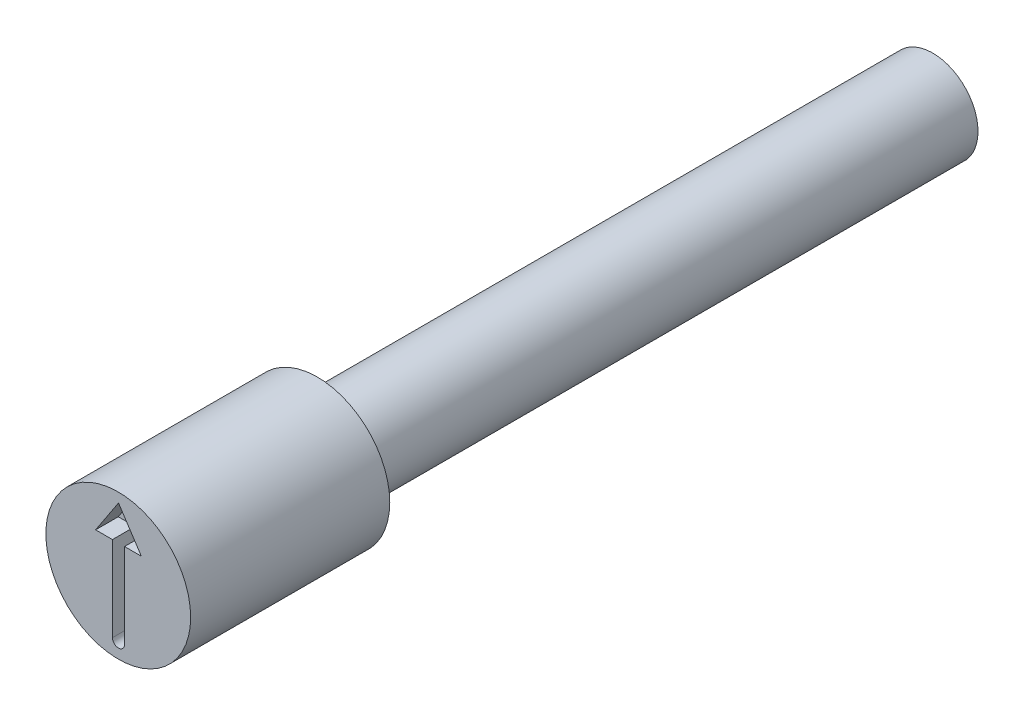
ISO-10303-21;
HEADER;
FILE_DESCRIPTION(('STEP AP214'),'2;1');
FILE_NAME('part.step','',(''),(''),'','','');
FILE_SCHEMA(('AUTOMOTIVE_DESIGN { 1 0 10303 214 1 1 1 1 }'));
ENDSEC;
DATA;
#1=APPLICATION_CONTEXT('core data for automotive mechanical design processes');
#2=APPLICATION_PROTOCOL_DEFINITION('international standard','automotive_design',2000,#1);
#3=PRODUCT_CONTEXT('',#1,'mechanical');
#4=PRODUCT('Part','Part','',(#3));
#5=PRODUCT_RELATED_PRODUCT_CATEGORY('part','',(#4));
#6=PRODUCT_DEFINITION_FORMATION('','',#4);
#7=PRODUCT_DEFINITION_CONTEXT('part definition',#1,'design');
#8=PRODUCT_DEFINITION('design','',#6,#7);
#9=PRODUCT_DEFINITION_SHAPE('','',#8);
#10=(LENGTH_UNIT() NAMED_UNIT(*) SI_UNIT(.MILLI.,.METRE.));
#11=(NAMED_UNIT(*) PLANE_ANGLE_UNIT() SI_UNIT($,.RADIAN.));
#12=(NAMED_UNIT(*) SI_UNIT($,.STERADIAN.) SOLID_ANGLE_UNIT());
#13=UNCERTAINTY_MEASURE_WITH_UNIT(LENGTH_MEASURE(1.E-05),#10,'distance_accuracy_value','');
#14=(GEOMETRIC_REPRESENTATION_CONTEXT(3) GLOBAL_UNCERTAINTY_ASSIGNED_CONTEXT((#13)) GLOBAL_UNIT_ASSIGNED_CONTEXT((#10,
#11,#12)) REPRESENTATION_CONTEXT('',''));
#15=CARTESIAN_POINT('',(0.,0.,0.));
#16=DIRECTION('',(0.,0.,1.));
#17=DIRECTION('',(1.,0.,0.));
#18=AXIS2_PLACEMENT_3D('',#15,#16,#17);
#19=CARTESIAN_POINT('',(0.,0.499999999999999,-2.2));
#20=DIRECTION('',(0.,0.,1.));
#21=DIRECTION('',(1.,0.,0.));
#22=AXIS2_PLACEMENT_3D('',#19,#20,#21);
#23=PLANE('',#22);
#24=CARTESIAN_POINT('',(0.,0.,-2.2));
#25=DIRECTION('',(0.,0.,1.));
#26=DIRECTION('',(1.,0.,0.));
#27=AXIS2_PLACEMENT_3D('',#24,#25,#26);
#28=CIRCLE('',#27,0.8);
#29=CARTESIAN_POINT('',(0.8,0.,-2.2));
#30=VERTEX_POINT('',#29);
#31=EDGE_CURVE('E11',#30,#30,#28,.T.);
#32=ORIENTED_EDGE('',*,*,#31,.F.);
#33=EDGE_LOOP('',(#32));
#34=FACE_BOUND('',#33,.T.);
#35=CARTESIAN_POINT('',(0.,0.,-2.2));
#36=DIRECTION('',(0.,0.,1.));
#37=DIRECTION('',(1.,0.,0.));
#38=AXIS2_PLACEMENT_3D('',#35,#36,#37);
#39=CIRCLE('',#38,0.499999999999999);
#40=CARTESIAN_POINT('',(0.499999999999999,0.,-2.2));
#41=VERTEX_POINT('',#40);
#42=EDGE_CURVE('E145',#41,#41,#39,.T.);
#43=ORIENTED_EDGE('',*,*,#42,.T.);
#44=EDGE_LOOP('',(#43));
#45=FACE_BOUND('',#44,.T.);
#46=ADVANCED_FACE('F35',(#34,#45),#23,.F.);
#47=CARTESIAN_POINT('',(0.,0.,-0.403888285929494));
#48=DIRECTION('',(0.,0.,1.));
#49=DIRECTION('',(1.,0.,0.));
#50=AXIS2_PLACEMENT_3D('',#47,#48,#49);
#51=CYLINDRICAL_SURFACE('',#50,0.8);
#52=CARTESIAN_POINT('',(0.,0.,0.));
#53=DIRECTION('',(0.,0.,1.));
#54=DIRECTION('',(1.,0.,0.));
#55=AXIS2_PLACEMENT_3D('',#52,#53,#54);
#56=CIRCLE('',#55,0.8);
#57=CARTESIAN_POINT('',(0.8,0.,0.));
#58=VERTEX_POINT('',#57);
#59=EDGE_CURVE('E42',#58,#58,#56,.T.);
#60=ORIENTED_EDGE('',*,*,#59,.F.);
#61=EDGE_LOOP('',(#60));
#62=FACE_BOUND('',#61,.T.);
#63=ORIENTED_EDGE('',*,*,#31,.T.);
#64=EDGE_LOOP('',(#63));
#65=FACE_BOUND('',#64,.T.);
#66=ADVANCED_FACE('F162',(#62,#65),#51,.T.);
#67=CARTESIAN_POINT('',(0.,0.8,0.));
#68=DIRECTION('',(0.,0.,-1.));
#69=DIRECTION('',(-1.,0.,0.));
#70=AXIS2_PLACEMENT_3D('',#67,#68,#69);
#71=PLANE('',#70);
#72=DIRECTION('',(0.,1.,0.));
#73=VECTOR('',#72,1.);
#74=CARTESIAN_POINT('',(0.0691688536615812,0.312374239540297,0.));
#75=LINE('',#74,#73);
#76=CARTESIAN_POINT('',(0.0691688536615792,-0.626505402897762,0.));
#77=VERTEX_POINT('',#76);
#78=CARTESIAN_POINT('',(0.0691688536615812,0.312374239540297,0.));
#79=VERTEX_POINT('',#78);
#80=EDGE_CURVE('E129',#77,#79,#75,.T.);
#81=ORIENTED_EDGE('',*,*,#80,.F.);
#82=CARTESIAN_POINT('',(0.00250326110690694,-0.626505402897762,0.));
#83=DIRECTION('',(0.,0.,1.));
#84=DIRECTION('',(1.,0.,0.));
#85=AXIS2_PLACEMENT_3D('',#82,#83,#84);
#86=CIRCLE('',#85,0.0666655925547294);
#87=CARTESIAN_POINT('',(-0.0641623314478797,-0.626505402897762,0.));
#88=VERTEX_POINT('',#87);
#89=EDGE_CURVE('E49',#88,#77,#86,.T.);
#90=ORIENTED_EDGE('',*,*,#89,.F.);
#91=DIRECTION('',(0.,-1.,0.));
#92=VECTOR('',#91,1.);
#93=CARTESIAN_POINT('',(-0.0641623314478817,0.312374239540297,0.));
#94=LINE('',#93,#92);
#95=CARTESIAN_POINT('',(-0.0641623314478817,0.312374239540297,0.));
#96=VERTEX_POINT('',#95);
#97=EDGE_CURVE('E141',#96,#88,#94,.T.);
#98=ORIENTED_EDGE('',*,*,#97,.F.);
#99=DIRECTION('',(1.,0.,0.));
#100=VECTOR('',#99,1.);
#101=CARTESIAN_POINT('',(-0.250167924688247,0.312374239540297,0.));
#102=LINE('',#101,#100);
#103=CARTESIAN_POINT('',(-0.250167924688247,0.312374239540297,0.));
#104=VERTEX_POINT('',#103);
#105=EDGE_CURVE('E139',#104,#96,#102,.T.);
#106=ORIENTED_EDGE('',*,*,#105,.F.);
#107=DIRECTION('',(-0.550159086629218,-0.835059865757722,0.));
#108=VECTOR('',#107,1.);
#109=CARTESIAN_POINT('',(0.00250326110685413,0.69589161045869,0.));
#110=LINE('',#109,#108);
#111=CARTESIAN_POINT('',(0.00250326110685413,0.69589161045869,0.));
#112=VERTEX_POINT('',#111);
#113=EDGE_CURVE('E103',#112,#104,#110,.T.);
#114=ORIENTED_EDGE('',*,*,#113,.F.);
#115=DIRECTION('',(-0.550159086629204,0.835059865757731,0.));
#116=VECTOR('',#115,1.);
#117=CARTESIAN_POINT('',(0.00250326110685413,0.69589161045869,0.));
#118=LINE('',#117,#116);
#119=CARTESIAN_POINT('',(0.255174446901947,0.312374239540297,0.));
#120=VERTEX_POINT('',#119);
#121=EDGE_CURVE('E135',#120,#112,#118,.T.);
#122=ORIENTED_EDGE('',*,*,#121,.F.);
#123=DIRECTION('',(1.,0.,0.));
#124=VECTOR('',#123,1.);
#125=CARTESIAN_POINT('',(0.255174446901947,0.312374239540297,0.));
#126=LINE('',#125,#124);
#127=EDGE_CURVE('E132',#79,#120,#126,.T.);
#128=ORIENTED_EDGE('',*,*,#127,.F.);
#129=EDGE_LOOP('',(#81,#90,#98,#106,#114,#122,#128));
#130=FACE_BOUND('',#129,.T.);
#131=ORIENTED_EDGE('',*,*,#59,.T.);
#132=EDGE_LOOP('',(#131));
#133=FACE_BOUND('',#132,.T.);
#134=ADVANCED_FACE('F160',(#130,#133),#71,.F.);
#135=CARTESIAN_POINT('',(0.,0.,-9.));
#136=DIRECTION('',(0.,0.,1.));
#137=DIRECTION('',(1.,0.,0.));
#138=AXIS2_PLACEMENT_3D('',#135,#136,#137);
#139=PLANE('',#138);
#140=CARTESIAN_POINT('',(0.,0.,-9.));
#141=DIRECTION('',(0.,0.,1.));
#142=DIRECTION('',(1.,0.,0.));
#143=AXIS2_PLACEMENT_3D('',#140,#141,#142);
#144=CIRCLE('',#143,0.5);
#145=CARTESIAN_POINT('',(0.5,0.,-9.));
#146=VERTEX_POINT('',#145);
#147=EDGE_CURVE('E155',#146,#146,#144,.T.);
#148=ORIENTED_EDGE('',*,*,#147,.F.);
#149=EDGE_LOOP('',(#148));
#150=FACE_BOUND('',#149,.T.);
#151=ADVANCED_FACE('F175',(#150),#139,.F.);
#152=CARTESIAN_POINT('',(0.,0.,-0.403888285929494));
#153=DIRECTION('',(0.,0.,1.));
#154=DIRECTION('',(1.,0.,0.));
#155=AXIS2_PLACEMENT_3D('',#152,#153,#154);
#156=CYLINDRICAL_SURFACE('',#155,0.5);
#157=ORIENTED_EDGE('',*,*,#42,.F.);
#158=EDGE_LOOP('',(#157));
#159=FACE_BOUND('',#158,.T.);
#160=ORIENTED_EDGE('',*,*,#147,.T.);
#161=EDGE_LOOP('',(#160));
#162=FACE_BOUND('',#161,.T.);
#163=ADVANCED_FACE('F171',(#159,#162),#156,.T.);
#164=CARTESIAN_POINT('',(0.00250326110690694,-0.626505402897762,-0.25));
#165=DIRECTION('',(0.,0.,1.));
#166=DIRECTION('',(1.,0.,0.));
#167=AXIS2_PLACEMENT_3D('',#164,#165,#166);
#168=CYLINDRICAL_SURFACE('',#167,0.0666655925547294);
#169=ORIENTED_EDGE('',*,*,#89,.T.);
#170=DIRECTION('',(0.,0.,1.));
#171=VECTOR('',#170,1.);
#172=CARTESIAN_POINT('',(0.0691688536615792,-0.626505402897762,-0.25));
#173=LINE('',#172,#171);
#174=CARTESIAN_POINT('',(0.0691688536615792,-0.626505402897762,-0.25));
#175=VERTEX_POINT('',#174);
#176=EDGE_CURVE('E82',#175,#77,#173,.T.);
#177=ORIENTED_EDGE('',*,*,#176,.F.);
#178=CARTESIAN_POINT('',(0.00250326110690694,-0.626505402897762,-0.25));
#179=DIRECTION('',(0.,0.,1.));
#180=DIRECTION('',(1.,0.,0.));
#181=AXIS2_PLACEMENT_3D('',#178,#179,#180);
#182=CIRCLE('',#181,0.0666655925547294);
#183=CARTESIAN_POINT('',(-0.0641623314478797,-0.626505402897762,-0.25));
#184=VERTEX_POINT('',#183);
#185=EDGE_CURVE('E143',#184,#175,#182,.T.);
#186=ORIENTED_EDGE('',*,*,#185,.F.);
#187=DIRECTION('',(0.,0.,1.));
#188=VECTOR('',#187,1.);
#189=CARTESIAN_POINT('',(-0.0641623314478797,-0.626505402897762,-0.25));
#190=LINE('',#189,#188);
#191=EDGE_CURVE('E57',#184,#88,#190,.T.);
#192=ORIENTED_EDGE('',*,*,#191,.T.);
#193=EDGE_LOOP('',(#169,#177,#186,#192));
#194=FACE_BOUND('',#193,.T.);
#195=ADVANCED_FACE('F174',(#194),#168,.F.);
#196=CARTESIAN_POINT('',(-0.0641623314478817,0.312374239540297,-0.25));
#197=DIRECTION('',(-1.,0.,0.));
#198=DIRECTION('',(0.,-1.,0.));
#199=AXIS2_PLACEMENT_3D('',#196,#197,#198);
#200=PLANE('',#199);
#201=ORIENTED_EDGE('',*,*,#97,.T.);
#202=ORIENTED_EDGE('',*,*,#191,.F.);
#203=DIRECTION('',(0.,-1.,0.));
#204=VECTOR('',#203,1.);
#205=CARTESIAN_POINT('',(-0.0641623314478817,0.312374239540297,-0.25));
#206=LINE('',#205,#204);
#207=CARTESIAN_POINT('',(-0.0641623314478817,0.312374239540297,-0.25));
#208=VERTEX_POINT('',#207);
#209=EDGE_CURVE('E115',#208,#184,#206,.T.);
#210=ORIENTED_EDGE('',*,*,#209,.F.);
#211=DIRECTION('',(0.,0.,1.));
#212=VECTOR('',#211,1.);
#213=CARTESIAN_POINT('',(-0.0641623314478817,0.312374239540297,-0.25));
#214=LINE('',#213,#212);
#215=EDGE_CURVE('E107',#208,#96,#214,.T.);
#216=ORIENTED_EDGE('',*,*,#215,.T.);
#217=EDGE_LOOP('',(#201,#202,#210,#216));
#218=FACE_BOUND('',#217,.T.);
#219=ADVANCED_FACE('F189',(#218),#200,.F.);
#220=CARTESIAN_POINT('',(-0.250167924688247,0.312374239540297,-0.25));
#221=DIRECTION('',(0.,-1.,0.));
#222=DIRECTION('',(0.,0.,-1.));
#223=AXIS2_PLACEMENT_3D('',#220,#221,#222);
#224=PLANE('',#223);
#225=ORIENTED_EDGE('',*,*,#105,.T.);
#226=ORIENTED_EDGE('',*,*,#215,.F.);
#227=DIRECTION('',(1.,0.,0.));
#228=VECTOR('',#227,1.);
#229=CARTESIAN_POINT('',(-0.250167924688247,0.312374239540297,-0.25));
#230=LINE('',#229,#228);
#231=CARTESIAN_POINT('',(-0.250167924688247,0.312374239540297,-0.25));
#232=VERTEX_POINT('',#231);
#233=EDGE_CURVE('E111',#232,#208,#230,.T.);
#234=ORIENTED_EDGE('',*,*,#233,.F.);
#235=DIRECTION('',(0.,0.,1.));
#236=VECTOR('',#235,1.);
#237=CARTESIAN_POINT('',(-0.250167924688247,0.312374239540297,-0.25));
#238=LINE('',#237,#236);
#239=EDGE_CURVE('E96',#232,#104,#238,.T.);
#240=ORIENTED_EDGE('',*,*,#239,.T.);
#241=EDGE_LOOP('',(#225,#226,#234,#240));
#242=FACE_BOUND('',#241,.T.);
#243=ADVANCED_FACE('F112',(#242),#224,.F.);
#244=CARTESIAN_POINT('',(0.00250326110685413,0.69589161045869,-0.25));
#245=DIRECTION('',(-0.835059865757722,0.550159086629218,0.));
#246=DIRECTION('',(-0.550159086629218,-0.835059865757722,0.));
#247=AXIS2_PLACEMENT_3D('',#244,#245,#246);
#248=PLANE('',#247);
#249=ORIENTED_EDGE('',*,*,#113,.T.);
#250=ORIENTED_EDGE('',*,*,#239,.F.);
#251=DIRECTION('',(-0.550159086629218,-0.835059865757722,0.));
#252=VECTOR('',#251,1.);
#253=CARTESIAN_POINT('',(0.00250326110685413,0.69589161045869,-0.25));
#254=LINE('',#253,#252);
#255=CARTESIAN_POINT('',(0.00250326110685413,0.69589161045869,-0.25));
#256=VERTEX_POINT('',#255);
#257=EDGE_CURVE('E100',#256,#232,#254,.T.);
#258=ORIENTED_EDGE('',*,*,#257,.F.);
#259=DIRECTION('',(0.,0.,1.));
#260=VECTOR('',#259,1.);
#261=CARTESIAN_POINT('',(0.00250326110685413,0.69589161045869,-0.25));
#262=LINE('',#261,#260);
#263=EDGE_CURVE('E108',#256,#112,#262,.T.);
#264=ORIENTED_EDGE('',*,*,#263,.T.);
#265=EDGE_LOOP('',(#249,#250,#258,#264));
#266=FACE_BOUND('',#265,.T.);
#267=ADVANCED_FACE('F98',(#266),#248,.F.);
#268=CARTESIAN_POINT('',(0.00250326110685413,0.69589161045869,-0.25));
#269=DIRECTION('',(0.835059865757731,0.550159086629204,0.));
#270=DIRECTION('',(-0.550159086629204,0.835059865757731,0.));
#271=AXIS2_PLACEMENT_3D('',#268,#269,#270);
#272=PLANE('',#271);
#273=ORIENTED_EDGE('',*,*,#121,.T.);
#274=ORIENTED_EDGE('',*,*,#263,.F.);
#275=DIRECTION('',(-0.550159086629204,0.835059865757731,0.));
#276=VECTOR('',#275,1.);
#277=CARTESIAN_POINT('',(0.00250326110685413,0.69589161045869,-0.25));
#278=LINE('',#277,#276);
#279=CARTESIAN_POINT('',(0.255174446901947,0.312374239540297,-0.25));
#280=VERTEX_POINT('',#279);
#281=EDGE_CURVE('E121',#280,#256,#278,.T.);
#282=ORIENTED_EDGE('',*,*,#281,.F.);
#283=DIRECTION('',(0.,0.,1.));
#284=VECTOR('',#283,1.);
#285=CARTESIAN_POINT('',(0.255174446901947,0.312374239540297,-0.25));
#286=LINE('',#285,#284);
#287=EDGE_CURVE('E148',#280,#120,#286,.T.);
#288=ORIENTED_EDGE('',*,*,#287,.T.);
#289=EDGE_LOOP('',(#273,#274,#282,#288));
#290=FACE_BOUND('',#289,.T.);
#291=ADVANCED_FACE('F197',(#290),#272,.F.);
#292=CARTESIAN_POINT('',(0.255174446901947,0.312374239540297,-0.25));
#293=DIRECTION('',(0.,-1.,0.));
#294=DIRECTION('',(0.,0.,-1.));
#295=AXIS2_PLACEMENT_3D('',#292,#293,#294);
#296=PLANE('',#295);
#297=ORIENTED_EDGE('',*,*,#127,.T.);
#298=ORIENTED_EDGE('',*,*,#287,.F.);
#299=DIRECTION('',(1.,0.,0.));
#300=VECTOR('',#299,1.);
#301=CARTESIAN_POINT('',(0.255174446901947,0.312374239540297,-0.25));
#302=LINE('',#301,#300);
#303=CARTESIAN_POINT('',(0.0691688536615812,0.312374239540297,-0.25));
#304=VERTEX_POINT('',#303);
#305=EDGE_CURVE('E123',#304,#280,#302,.T.);
#306=ORIENTED_EDGE('',*,*,#305,.F.);
#307=DIRECTION('',(0.,0.,1.));
#308=VECTOR('',#307,1.);
#309=CARTESIAN_POINT('',(0.0691688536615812,0.312374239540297,-0.25));
#310=LINE('',#309,#308);
#311=EDGE_CURVE('E150',#304,#79,#310,.T.);
#312=ORIENTED_EDGE('',*,*,#311,.T.);
#313=EDGE_LOOP('',(#297,#298,#306,#312));
#314=FACE_BOUND('',#313,.T.);
#315=ADVANCED_FACE('F193',(#314),#296,.F.);
#316=CARTESIAN_POINT('',(0.0691688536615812,0.312374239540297,-0.25));
#317=DIRECTION('',(1.,0.,0.));
#318=DIRECTION('',(0.,1.,0.));
#319=AXIS2_PLACEMENT_3D('',#316,#317,#318);
#320=PLANE('',#319);
#321=ORIENTED_EDGE('',*,*,#80,.T.);
#322=ORIENTED_EDGE('',*,*,#311,.F.);
#323=DIRECTION('',(0.,1.,0.));
#324=VECTOR('',#323,1.);
#325=CARTESIAN_POINT('',(0.0691688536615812,0.312374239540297,-0.25));
#326=LINE('',#325,#324);
#327=EDGE_CURVE('E291',#175,#304,#326,.T.);
#328=ORIENTED_EDGE('',*,*,#327,.F.);
#329=ORIENTED_EDGE('',*,*,#176,.T.);
#330=EDGE_LOOP('',(#321,#322,#328,#329));
#331=FACE_BOUND('',#330,.T.);
#332=ADVANCED_FACE('F190',(#331),#320,.F.);
#333=CARTESIAN_POINT('',(0.00250326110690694,-0.626505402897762,-0.25));
#334=DIRECTION('',(0.,0.,1.));
#335=DIRECTION('',(1.,0.,0.));
#336=AXIS2_PLACEMENT_3D('',#333,#334,#335);
#337=PLANE('',#336);
#338=ORIENTED_EDGE('',*,*,#185,.T.);
#339=ORIENTED_EDGE('',*,*,#327,.T.);
#340=ORIENTED_EDGE('',*,*,#305,.T.);
#341=ORIENTED_EDGE('',*,*,#281,.T.);
#342=ORIENTED_EDGE('',*,*,#257,.T.);
#343=ORIENTED_EDGE('',*,*,#233,.T.);
#344=ORIENTED_EDGE('',*,*,#209,.T.);
#345=EDGE_LOOP('',(#338,#339,#340,#341,#342,#343,#344));
#346=FACE_BOUND('',#345,.T.);
#347=ADVANCED_FACE('F118',(#346),#337,.T.);
#348=CLOSED_SHELL('',(#46,#66,#134,#151,#163,#195,#219,#243,#267,#291,#315,#332,#347));
#349=MANIFOLD_SOLID_BREP('B2',#348);
#350=ADVANCED_BREP_SHAPE_REPRESENTATION('',(#18,#349),#14);
#351=SHAPE_DEFINITION_REPRESENTATION(#9,#350);
ENDSEC;
END-ISO-10303-21;
